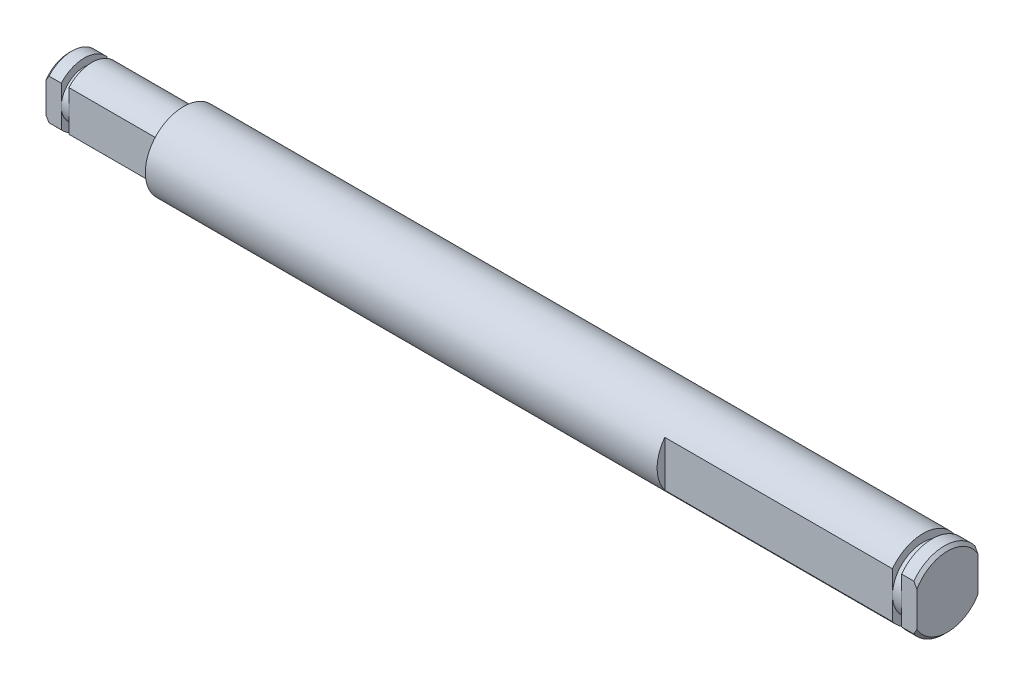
ISO-10303-21;
HEADER;
FILE_DESCRIPTION(('STEP AP214'),'2;1');
FILE_NAME('part.step','',(''),(''),'','','');
FILE_SCHEMA(('AUTOMOTIVE_DESIGN { 1 0 10303 214 1 1 1 1 }'));
ENDSEC;
DATA;
#1=APPLICATION_CONTEXT('core data for automotive mechanical design processes');
#2=APPLICATION_PROTOCOL_DEFINITION('international standard','automotive_design',2000,#1);
#3=PRODUCT_CONTEXT('',#1,'mechanical');
#4=PRODUCT('Part','Part','',(#3));
#5=PRODUCT_RELATED_PRODUCT_CATEGORY('part','',(#4));
#6=PRODUCT_DEFINITION_FORMATION('','',#4);
#7=PRODUCT_DEFINITION_CONTEXT('part definition',#1,'design');
#8=PRODUCT_DEFINITION('design','',#6,#7);
#9=PRODUCT_DEFINITION_SHAPE('','',#8);
#10=(LENGTH_UNIT() NAMED_UNIT(*) SI_UNIT(.MILLI.,.METRE.));
#11=(NAMED_UNIT(*) PLANE_ANGLE_UNIT() SI_UNIT($,.RADIAN.));
#12=(NAMED_UNIT(*) SI_UNIT($,.STERADIAN.) SOLID_ANGLE_UNIT());
#13=UNCERTAINTY_MEASURE_WITH_UNIT(LENGTH_MEASURE(1.E-05),#10,'distance_accuracy_value','');
#14=(GEOMETRIC_REPRESENTATION_CONTEXT(3) GLOBAL_UNCERTAINTY_ASSIGNED_CONTEXT((#13)) GLOBAL_UNIT_ASSIGNED_CONTEXT((#10,
#11,#12)) REPRESENTATION_CONTEXT('',''));
#15=CARTESIAN_POINT('',(0.,0.,0.));
#16=DIRECTION('',(0.,0.,1.));
#17=DIRECTION('',(1.,0.,0.));
#18=AXIS2_PLACEMENT_3D('',#15,#16,#17);
#19=CARTESIAN_POINT('',(-14.5998699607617,0.,0.));
#20=DIRECTION('',(1.,0.,0.));
#21=DIRECTION('',(0.,0.,-1.));
#22=AXIS2_PLACEMENT_3D('',#19,#20,#21);
#23=CONICAL_SURFACE('',#22,3.99999999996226,0.78538190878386);
#24=CARTESIAN_POINT('',(-14.5998699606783,2.64575131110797,-2.99999999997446));
#25=CARTESIAN_POINT('',(-14.6352080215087,2.592322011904,-2.99999999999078));
#26=CARTESIAN_POINT('',(-14.6701329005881,2.53861676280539,-2.99999999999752));
#27=CARTESIAN_POINT('',(-14.7390206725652,2.43062279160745,-3.00000000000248));
#28=CARTESIAN_POINT('',(-14.7729839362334,2.37633430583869,-3.00000000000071));
#29=CARTESIAN_POINT('',(-14.8398428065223,2.26709711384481,-2.99999999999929));
#30=CARTESIAN_POINT('',(-14.8727383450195,2.21214836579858,-2.99999999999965));
#31=CARTESIAN_POINT('',(-14.9373190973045,2.10151601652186,-3.00000000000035));
#32=CARTESIAN_POINT('',(-14.9690038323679,2.04583213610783,-3.00000000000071));
#33=CARTESIAN_POINT('',(-15.0000000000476,1.98976314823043,-3.));
#34=B_SPLINE_CURVE_WITH_KNOTS('',3,(#24,#25,#26,#27,#28,#29,#30,#31,#32,#33),.UNSPECIFIED.,.F.,
.F.,(4,2,2,2,4),(0.,0.192176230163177,0.38427732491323,0.576390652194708,0.768579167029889),.UNSPECIFIED.);
#35=CARTESIAN_POINT('',(-14.59986996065,2.64575131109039,-3.));
#36=VERTEX_POINT('',#35);
#37=CARTESIAN_POINT('',(-15.000000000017,1.9897631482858,-3.));
#38=VERTEX_POINT('',#37);
#39=EDGE_CURVE('E191',#36,#38,#34,.T.);
#40=ORIENTED_EDGE('',*,*,#39,.T.);
#41=CARTESIAN_POINT('',(-14.9999999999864,0.,0.));
#42=DIRECTION('',(1.,0.,0.));
#43=DIRECTION('',(0.,0.,-1.));
#44=AXIS2_PLACEMENT_3D('',#41,#42,#43);
#45=CIRCLE('',#44,3.59988296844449);
#46=CARTESIAN_POINT('',(-15.0000000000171,1.98976314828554,3.));
#47=VERTEX_POINT('',#46);
#48=EDGE_CURVE('E189',#38,#47,#45,.T.);
#49=ORIENTED_EDGE('',*,*,#48,.T.);
#50=CARTESIAN_POINT('',(-15.0000000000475,1.98976314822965,2.99999999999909));
#51=CARTESIAN_POINT('',(-14.9690038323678,2.04583213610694,2.99999999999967));
#52=CARTESIAN_POINT('',(-14.9373190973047,2.10151601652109,2.99999999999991));
#53=CARTESIAN_POINT('',(-14.8727383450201,2.21214836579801,3.00000000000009));
#54=CARTESIAN_POINT('',(-14.839842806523,2.26709711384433,3.00000000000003));
#55=CARTESIAN_POINT('',(-14.7729839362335,2.3763343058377,2.99999999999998));
#56=CARTESIAN_POINT('',(-14.7390206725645,2.43062279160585,2.99999999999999));
#57=CARTESIAN_POINT('',(-14.6701329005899,2.53861676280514,3.00000000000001));
#58=CARTESIAN_POINT('',(-14.6352080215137,2.59232201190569,3.00000000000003));
#59=CARTESIAN_POINT('',(-14.5998699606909,2.64575131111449,3.));
#60=B_SPLINE_CURVE_WITH_KNOTS('',3,(#50,#51,#52,#53,#54,#55,#56,#57,#58,#59),.UNSPECIFIED.,.F.,
.F.,(4,2,2,2,4),(0.,0.19218851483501,0.384301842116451,0.576402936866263,0.768579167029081),.UNSPECIFIED.);
#61=CARTESIAN_POINT('',(-14.5998699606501,2.64575131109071,3.));
#62=VERTEX_POINT('',#61);
#63=EDGE_CURVE('E21',#47,#62,#60,.T.);
#64=ORIENTED_EDGE('',*,*,#63,.T.);
#65=CARTESIAN_POINT('',(-14.59986996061,0.,0.));
#66=DIRECTION('',(1.,0.,0.));
#67=DIRECTION('',(0.,0.,-1.));
#68=AXIS2_PLACEMENT_3D('',#65,#66,#67);
#69=CIRCLE('',#68,4.);
#70=EDGE_CURVE('E186',#36,#62,#69,.T.);
#71=ORIENTED_EDGE('',*,*,#70,.F.);
#72=EDGE_LOOP('',(#40,#49,#64,#71));
#73=FACE_BOUND('',#72,.T.);
#74=ADVANCED_FACE('F17',(#73),#23,.T.);
#75=CARTESIAN_POINT('',(-14.5998699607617,0.,0.));
#76=DIRECTION('',(1.,0.,0.));
#77=DIRECTION('',(0.,0.,-1.));
#78=AXIS2_PLACEMENT_3D('',#75,#76,#77);
#79=CONICAL_SURFACE('',#78,3.99999999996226,0.78538190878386);
#80=CARTESIAN_POINT('',(-14.59986996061,0.,0.));
#81=DIRECTION('',(1.,0.,0.));
#82=DIRECTION('',(0.,0.,-1.));
#83=AXIS2_PLACEMENT_3D('',#80,#81,#82);
#84=CIRCLE('',#83,4.);
#85=CARTESIAN_POINT('',(-14.59986996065,-2.64575131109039,3.));
#86=VERTEX_POINT('',#85);
#87=CARTESIAN_POINT('',(-14.5998699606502,-2.64575131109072,-3.));
#88=VERTEX_POINT('',#87);
#89=EDGE_CURVE('E200',#86,#88,#84,.T.);
#90=ORIENTED_EDGE('',*,*,#89,.F.);
#91=CARTESIAN_POINT('',(-14.5998699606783,-2.64575131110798,2.99999999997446));
#92=CARTESIAN_POINT('',(-14.6352080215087,-2.59232201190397,2.99999999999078));
#93=CARTESIAN_POINT('',(-14.6701329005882,-2.53861676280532,2.99999999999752));
#94=CARTESIAN_POINT('',(-14.7390206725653,-2.43062279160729,3.00000000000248));
#95=CARTESIAN_POINT('',(-14.7729839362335,-2.37633430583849,3.00000000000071));
#96=CARTESIAN_POINT('',(-14.8398428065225,-2.26709711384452,2.99999999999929));
#97=CARTESIAN_POINT('',(-14.8727383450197,-2.21214836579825,2.99999999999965));
#98=CARTESIAN_POINT('',(-14.9373190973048,-2.10151601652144,3.00000000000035));
#99=CARTESIAN_POINT('',(-14.9690038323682,-2.04583213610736,3.00000000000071));
#100=CARTESIAN_POINT('',(-15.0000000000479,-1.98976314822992,3.));
#101=B_SPLINE_CURVE_WITH_KNOTS('',3,(#91,#92,#93,#94,#95,#96,#97,#98,#99,#100),.UNSPECIFIED.,
.F.,.F.,(4,2,2,2,4),(0.,0.192176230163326,0.384277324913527,0.576390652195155,
0.768579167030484),.UNSPECIFIED.);
#102=CARTESIAN_POINT('',(-15.0000000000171,-1.98976314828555,3.));
#103=VERTEX_POINT('',#102);
#104=EDGE_CURVE('E690',#86,#103,#101,.T.);
#105=ORIENTED_EDGE('',*,*,#104,.T.);
#106=CARTESIAN_POINT('',(-14.9999999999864,0.,0.));
#107=DIRECTION('',(1.,0.,0.));
#108=DIRECTION('',(0.,0.,-1.));
#109=AXIS2_PLACEMENT_3D('',#106,#107,#108);
#110=CIRCLE('',#109,3.59988296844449);
#111=CARTESIAN_POINT('',(-15.0000000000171,-1.98976314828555,-3.));
#112=VERTEX_POINT('',#111);
#113=EDGE_CURVE('E701',#103,#112,#110,.T.);
#114=ORIENTED_EDGE('',*,*,#113,.T.);
#115=CARTESIAN_POINT('',(-15.0000000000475,-1.98976314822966,-2.99999999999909));
#116=CARTESIAN_POINT('',(-14.9690038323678,-2.04583213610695,-2.99999999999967));
#117=CARTESIAN_POINT('',(-14.9373190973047,-2.1015160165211,-2.99999999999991));
#118=CARTESIAN_POINT('',(-14.8727383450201,-2.21214836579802,-3.00000000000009));
#119=CARTESIAN_POINT('',(-14.839842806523,-2.26709711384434,-3.00000000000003));
#120=CARTESIAN_POINT('',(-14.7729839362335,-2.37633430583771,-2.99999999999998));
#121=CARTESIAN_POINT('',(-14.7390206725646,-2.43062279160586,-2.99999999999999));
#122=CARTESIAN_POINT('',(-14.6701329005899,-2.53861676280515,-3.00000000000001));
#123=CARTESIAN_POINT('',(-14.6352080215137,-2.5923220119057,-3.00000000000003));
#124=CARTESIAN_POINT('',(-14.5998699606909,-2.6457513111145,-3.));
#125=B_SPLINE_CURVE_WITH_KNOTS('',3,(#115,#116,#117,#118,#119,#120,#121,#122,#123,#124),
.UNSPECIFIED.,.F.,.F.,(4,2,2,2,4),(0.,0.192188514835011,0.384301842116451,0.576402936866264,
0.768579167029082),.UNSPECIFIED.);
#126=EDGE_CURVE('E695',#112,#88,#125,.T.);
#127=ORIENTED_EDGE('',*,*,#126,.T.);
#128=EDGE_LOOP('',(#90,#105,#114,#127));
#129=FACE_BOUND('',#128,.T.);
#130=ADVANCED_FACE('F668',(#129),#79,.T.);
#131=CARTESIAN_POINT('',(-15.,0.,0.));
#132=DIRECTION('',(1.,0.,0.));
#133=DIRECTION('',(0.,0.,-1.));
#134=AXIS2_PLACEMENT_3D('',#131,#132,#133);
#135=PLANE('',#134);
#136=DIRECTION('',(0.,1.,0.));
#137=VECTOR('',#136,1.);
#138=CARTESIAN_POINT('',(-15.,4.,-3.));
#139=LINE('',#138,#137);
#140=EDGE_CURVE('E208',#38,#112,#139,.F.);
#141=ORIENTED_EDGE('',*,*,#140,.T.);
#142=ORIENTED_EDGE('',*,*,#113,.F.);
#143=DIRECTION('',(0.,1.,0.));
#144=VECTOR('',#143,1.);
#145=CARTESIAN_POINT('',(-15.,-4.,3.));
#146=LINE('',#145,#144);
#147=EDGE_CURVE('E206',#103,#47,#146,.T.);
#148=ORIENTED_EDGE('',*,*,#147,.T.);
#149=ORIENTED_EDGE('',*,*,#48,.F.);
#150=EDGE_LOOP('',(#141,#142,#148,#149));
#151=FACE_BOUND('',#150,.T.);
#152=ADVANCED_FACE('F661',(#151),#135,.F.);
#153=CARTESIAN_POINT('',(0.,0.,0.));
#154=DIRECTION('',(1.,0.,0.));
#155=DIRECTION('',(0.,0.,-1.));
#156=AXIS2_PLACEMENT_3D('',#153,#154,#155);
#157=CYLINDRICAL_SURFACE('',#156,4.);
#158=DIRECTION('',(-1.,0.,0.));
#159=VECTOR('',#158,1.);
#160=CARTESIAN_POINT('',(0.,2.645751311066,3.));
#161=LINE('',#160,#159);
#162=CARTESIAN_POINT('',(-13.,2.6457513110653,3.));
#163=VERTEX_POINT('',#162);
#164=EDGE_CURVE('E196',#62,#163,#161,.F.);
#165=ORIENTED_EDGE('',*,*,#164,.T.);
#166=CARTESIAN_POINT('',(-13.,0.,0.));
#167=DIRECTION('',(1.,0.,0.));
#168=DIRECTION('',(0.,0.,-1.));
#169=AXIS2_PLACEMENT_3D('',#166,#167,#168);
#170=CIRCLE('',#169,4.);
#171=CARTESIAN_POINT('',(-13.,2.6457513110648,-3.));
#172=VERTEX_POINT('',#171);
#173=EDGE_CURVE('E225',#163,#172,#170,.F.);
#174=ORIENTED_EDGE('',*,*,#173,.T.);
#175=DIRECTION('',(1.,0.,0.));
#176=VECTOR('',#175,1.);
#177=CARTESIAN_POINT('',(0.,2.645751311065,-3.));
#178=LINE('',#177,#176);
#179=EDGE_CURVE('E199',#172,#36,#178,.F.);
#180=ORIENTED_EDGE('',*,*,#179,.T.);
#181=ORIENTED_EDGE('',*,*,#70,.T.);
#182=EDGE_LOOP('',(#165,#174,#180,#181));
#183=FACE_BOUND('',#182,.T.);
#184=ADVANCED_FACE('F195',(#183),#157,.T.);
#185=CARTESIAN_POINT('',(0.,0.,0.));
#186=DIRECTION('',(1.,0.,0.));
#187=DIRECTION('',(0.,0.,-1.));
#188=AXIS2_PLACEMENT_3D('',#185,#186,#187);
#189=CYLINDRICAL_SURFACE('',#188,4.);
#190=DIRECTION('',(1.,0.,0.));
#191=VECTOR('',#190,1.);
#192=CARTESIAN_POINT('',(0.,-2.645751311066,-3.));
#193=LINE('',#192,#191);
#194=CARTESIAN_POINT('',(-13.,-2.6457513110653,-3.));
#195=VERTEX_POINT('',#194);
#196=EDGE_CURVE('E215',#88,#195,#193,.T.);
#197=ORIENTED_EDGE('',*,*,#196,.T.);
#198=CARTESIAN_POINT('',(-13.,0.,0.));
#199=DIRECTION('',(1.,0.,0.));
#200=DIRECTION('',(0.,0.,-1.));
#201=AXIS2_PLACEMENT_3D('',#198,#199,#200);
#202=CIRCLE('',#201,4.);
#203=CARTESIAN_POINT('',(-13.,-2.6457513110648,3.));
#204=VERTEX_POINT('',#203);
#205=EDGE_CURVE('E222',#195,#204,#202,.F.);
#206=ORIENTED_EDGE('',*,*,#205,.T.);
#207=DIRECTION('',(-1.,0.,0.));
#208=VECTOR('',#207,1.);
#209=CARTESIAN_POINT('',(0.,-2.645751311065,3.));
#210=LINE('',#209,#208);
#211=EDGE_CURVE('E210',#204,#86,#210,.T.);
#212=ORIENTED_EDGE('',*,*,#211,.T.);
#213=ORIENTED_EDGE('',*,*,#89,.T.);
#214=EDGE_LOOP('',(#197,#206,#212,#213));
#215=FACE_BOUND('',#214,.T.);
#216=ADVANCED_FACE('F648',(#215),#189,.T.);
#217=CARTESIAN_POINT('',(0.,-4.,3.));
#218=DIRECTION('',(0.,0.,-1.));
#219=DIRECTION('',(-1.,0.,0.));
#220=AXIS2_PLACEMENT_3D('',#217,#218,#219);
#221=PLANE('',#220);
#222=ORIENTED_EDGE('',*,*,#164,.F.);
#223=ORIENTED_EDGE('',*,*,#63,.F.);
#224=ORIENTED_EDGE('',*,*,#147,.F.);
#225=ORIENTED_EDGE('',*,*,#104,.F.);
#226=ORIENTED_EDGE('',*,*,#211,.F.);
#227=DIRECTION('',(0.,1.,0.));
#228=VECTOR('',#227,1.);
#229=CARTESIAN_POINT('',(-13.,0.,3.));
#230=LINE('',#229,#228);
#231=CARTESIAN_POINT('',(-13.,0.,3.));
#232=VERTEX_POINT('',#231);
#233=EDGE_CURVE('E230',#204,#232,#230,.T.);
#234=ORIENTED_EDGE('',*,*,#233,.T.);
#235=DIRECTION('',(0.,1.,0.));
#236=VECTOR('',#235,1.);
#237=CARTESIAN_POINT('',(-13.,0.,3.));
#238=LINE('',#237,#236);
#239=EDGE_CURVE('E205',#232,#163,#238,.T.);
#240=ORIENTED_EDGE('',*,*,#239,.T.);
#241=EDGE_LOOP('',(#222,#223,#224,#225,#226,#234,#240));
#242=FACE_BOUND('',#241,.T.);
#243=ADVANCED_FACE('F202',(#242),#221,.F.);
#244=CARTESIAN_POINT('',(0.,4.,-3.));
#245=DIRECTION('',(0.,0.,1.));
#246=DIRECTION('',(1.,0.,0.));
#247=AXIS2_PLACEMENT_3D('',#244,#245,#246);
#248=PLANE('',#247);
#249=ORIENTED_EDGE('',*,*,#196,.F.);
#250=ORIENTED_EDGE('',*,*,#126,.F.);
#251=ORIENTED_EDGE('',*,*,#140,.F.);
#252=ORIENTED_EDGE('',*,*,#39,.F.);
#253=ORIENTED_EDGE('',*,*,#179,.F.);
#254=DIRECTION('',(0.,1.,0.));
#255=VECTOR('',#254,1.);
#256=CARTESIAN_POINT('',(-13.,0.,-3.));
#257=LINE('',#256,#255);
#258=CARTESIAN_POINT('',(-13.,0.,-3.));
#259=VERTEX_POINT('',#258);
#260=EDGE_CURVE('E223',#172,#259,#257,.F.);
#261=ORIENTED_EDGE('',*,*,#260,.T.);
#262=DIRECTION('',(0.,1.,0.));
#263=VECTOR('',#262,1.);
#264=CARTESIAN_POINT('',(-13.,0.,-3.));
#265=LINE('',#264,#263);
#266=EDGE_CURVE('E226',#259,#195,#265,.F.);
#267=ORIENTED_EDGE('',*,*,#266,.T.);
#268=EDGE_LOOP('',(#249,#250,#251,#252,#253,#261,#267));
#269=FACE_BOUND('',#268,.T.);
#270=ADVANCED_FACE('F440',(#269),#248,.F.);
#271=CARTESIAN_POINT('',(99.599822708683,0.,0.));
#272=DIRECTION('',(-1.,0.,0.));
#273=DIRECTION('',(0.,-1.,0.));
#274=AXIS2_PLACEMENT_3D('',#271,#272,#273);
#275=CONICAL_SURFACE('',#274,4.99999999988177,0.785380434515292);
#276=CARTESIAN_POINT('',(99.59982270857,0.,0.));
#277=DIRECTION('',(1.,0.,0.));
#278=DIRECTION('',(0.,0.,-1.));
#279=AXIS2_PLACEMENT_3D('',#276,#277,#278);
#280=CIRCLE('',#279,5.);
#281=CARTESIAN_POINT('',(99.599822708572,-2.99999999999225,-4.));
#282=VERTEX_POINT('',#281);
#283=CARTESIAN_POINT('',(99.599822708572,-2.99999999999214,4.00000000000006));
#284=VERTEX_POINT('',#283);
#285=EDGE_CURVE('E326',#282,#284,#280,.F.);
#286=ORIENTED_EDGE('',*,*,#285,.F.);
#287=CARTESIAN_POINT('',(99.5998227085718,-2.9999999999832,-3.99999999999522));
#288=CARTESIAN_POINT('',(99.6354838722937,-2.94056285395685,-3.99999999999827));
#289=CARTESIAN_POINT('',(99.6706509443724,-2.8808266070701,-3.99999999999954));
#290=CARTESIAN_POINT('',(99.7398612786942,-2.76074011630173,-4.00000000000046));
#291=CARTESIAN_POINT('',(99.7739050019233,-2.70039013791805,-4.00000000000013));
#292=CARTESIAN_POINT('',(99.8407646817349,-2.57900773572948,-3.99999999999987));
#293=CARTESIAN_POINT('',(99.8735805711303,-2.51797527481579,-3.99999999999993));
#294=CARTESIAN_POINT('',(99.9378513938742,-2.39516619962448,-4.00000000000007));
#295=CARTESIAN_POINT('',(99.9693057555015,-2.33338928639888,-4.00000000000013));
#296=CARTESIAN_POINT('',(100.000000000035,-2.27123303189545,-4.));
#297=B_SPLINE_CURVE_WITH_KNOTS('',3,(#287,#288,#289,#290,#291,#292,#293,#294,#295,#296),
.UNSPECIFIED.,.F.,.F.,(4,2,2,2,4),(0.,0.207944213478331,0.415802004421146,0.623671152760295,
0.83162675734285),.UNSPECIFIED.);
#298=CARTESIAN_POINT('',(100.000000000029,-2.27123303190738,-4.));
#299=VERTEX_POINT('',#298);
#300=EDGE_CURVE('E428',#282,#299,#297,.T.);
#301=ORIENTED_EDGE('',*,*,#300,.T.);
#302=CARTESIAN_POINT('',(100.000000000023,0.,0.));
#303=DIRECTION('',(-1.,0.,0.));
#304=DIRECTION('',(0.,-1.,0.));
#305=AXIS2_PLACEMENT_3D('',#302,#303,#304);
#306=CIRCLE('',#305,4.5998368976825);
#307=CARTESIAN_POINT('',(100.000000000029,-2.27123303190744,4.));
#308=VERTEX_POINT('',#307);
#309=EDGE_CURVE('E371',#308,#299,#306,.F.);
#310=ORIENTED_EDGE('',*,*,#309,.F.);
#311=CARTESIAN_POINT('',(100.000000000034,-2.27123303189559,4.));
#312=CARTESIAN_POINT('',(99.9693057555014,-2.33338928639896,4.));
#313=CARTESIAN_POINT('',(99.9378513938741,-2.39516619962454,4.));
#314=CARTESIAN_POINT('',(99.8735805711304,-2.51797527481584,4.));
#315=CARTESIAN_POINT('',(99.840764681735,-2.57900773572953,4.));
#316=CARTESIAN_POINT('',(99.7739050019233,-2.70039013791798,4.));
#317=CARTESIAN_POINT('',(99.739861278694,-2.76074011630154,4.));
#318=CARTESIAN_POINT('',(99.6706509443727,-2.88082660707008,4.));
#319=CARTESIAN_POINT('',(99.6354838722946,-2.94056285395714,4.));
#320=CARTESIAN_POINT('',(99.5998227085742,-2.99999999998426,4.));
#321=B_SPLINE_CURVE_WITH_KNOTS('',3,(#311,#312,#313,#314,#315,#316,#317,#318,#319,#320),
.UNSPECIFIED.,.F.,.F.,(4,2,2,2,4),(0.,0.207955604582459,0.415824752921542,0.623682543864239,
0.831626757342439),.UNSPECIFIED.);
#322=EDGE_CURVE('E218',#308,#284,#321,.T.);
#323=ORIENTED_EDGE('',*,*,#322,.T.);
#324=EDGE_LOOP('',(#286,#301,#310,#323));
#325=FACE_BOUND('',#324,.T.);
#326=ADVANCED_FACE('F434',(#325),#275,.T.);
#327=CARTESIAN_POINT('',(-13.,0.,0.));
#328=DIRECTION('',(-1.,0.,0.));
#329=DIRECTION('',(0.,0.,1.));
#330=AXIS2_PLACEMENT_3D('',#327,#328,#329);
#331=PLANE('',#330);
#332=ORIENTED_EDGE('',*,*,#239,.F.);
#333=CARTESIAN_POINT('',(-13.,0.,0.));
#334=DIRECTION('',(-1.,0.,0.));
#335=DIRECTION('',(0.,0.,1.));
#336=AXIS2_PLACEMENT_3D('',#333,#334,#335);
#337=CIRCLE('',#336,3.);
#338=EDGE_CURVE('E369',#259,#232,#337,.F.);
#339=ORIENTED_EDGE('',*,*,#338,.F.);
#340=ORIENTED_EDGE('',*,*,#260,.F.);
#341=ORIENTED_EDGE('',*,*,#173,.F.);
#342=EDGE_LOOP('',(#332,#339,#340,#341));
#343=FACE_BOUND('',#342,.T.);
#344=ADVANCED_FACE('F439',(#343),#331,.F.);
#345=CARTESIAN_POINT('',(-13.,0.,0.));
#346=DIRECTION('',(-1.,0.,0.));
#347=DIRECTION('',(0.,0.,1.));
#348=AXIS2_PLACEMENT_3D('',#345,#346,#347);
#349=PLANE('',#348);
#350=CARTESIAN_POINT('',(-13.,0.,0.));
#351=DIRECTION('',(-1.,0.,0.));
#352=DIRECTION('',(0.,0.,1.));
#353=AXIS2_PLACEMENT_3D('',#350,#351,#352);
#354=CIRCLE('',#353,3.);
#355=EDGE_CURVE('E366',#232,#259,#354,.F.);
#356=ORIENTED_EDGE('',*,*,#355,.F.);
#357=ORIENTED_EDGE('',*,*,#233,.F.);
#358=ORIENTED_EDGE('',*,*,#205,.F.);
#359=ORIENTED_EDGE('',*,*,#266,.F.);
#360=EDGE_LOOP('',(#356,#357,#358,#359));
#361=FACE_BOUND('',#360,.T.);
#362=ADVANCED_FACE('F445',(#361),#349,.F.);
#363=CARTESIAN_POINT('',(0.,0.,0.));
#364=DIRECTION('',(1.,0.,0.));
#365=DIRECTION('',(0.,0.,-1.));
#366=AXIS2_PLACEMENT_3D('',#363,#364,#365);
#367=CYLINDRICAL_SURFACE('',#366,5.);
#368=DIRECTION('',(1.,0.,0.));
#369=VECTOR('',#368,1.);
#370=CARTESIAN_POINT('',(0.,-2.99999999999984,4.00000000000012));
#371=LINE('',#370,#369);
#372=CARTESIAN_POINT('',(98.,-2.99999999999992,4.00000000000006));
#373=VERTEX_POINT('',#372);
#374=EDGE_CURVE('E323',#284,#373,#371,.F.);
#375=ORIENTED_EDGE('',*,*,#374,.T.);
#376=CARTESIAN_POINT('',(98.,0.,0.));
#377=DIRECTION('',(1.,0.,0.));
#378=DIRECTION('',(0.,0.,-1.));
#379=AXIS2_PLACEMENT_3D('',#376,#377,#378);
#380=CIRCLE('',#379,5.);
#381=CARTESIAN_POINT('',(98.,-3.,-4.));
#382=VERTEX_POINT('',#381);
#383=EDGE_CURVE('E322',#373,#382,#380,.T.);
#384=ORIENTED_EDGE('',*,*,#383,.T.);
#385=DIRECTION('',(1.,0.,0.));
#386=VECTOR('',#385,1.);
#387=CARTESIAN_POINT('',(0.,-3.,-4.));
#388=LINE('',#387,#386);
#389=EDGE_CURVE('E229',#382,#282,#388,.T.);
#390=ORIENTED_EDGE('',*,*,#389,.T.);
#391=ORIENTED_EDGE('',*,*,#285,.T.);
#392=EDGE_LOOP('',(#375,#384,#390,#391));
#393=FACE_BOUND('',#392,.T.);
#394=ADVANCED_FACE('F398',(#393),#367,.T.);
#395=CARTESIAN_POINT('',(99.599822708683,0.,0.));
#396=DIRECTION('',(-1.,0.,0.));
#397=DIRECTION('',(0.,-1.,0.));
#398=AXIS2_PLACEMENT_3D('',#395,#396,#397);
#399=CONICAL_SURFACE('',#398,4.99999999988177,0.785380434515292);
#400=CARTESIAN_POINT('',(100.000000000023,0.,0.));
#401=DIRECTION('',(-1.,0.,0.));
#402=DIRECTION('',(0.,-1.,0.));
#403=AXIS2_PLACEMENT_3D('',#400,#401,#402);
#404=CIRCLE('',#403,4.59983689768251);
#405=CARTESIAN_POINT('',(100.000000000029,2.27123303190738,-4.));
#406=VERTEX_POINT('',#405);
#407=CARTESIAN_POINT('',(100.000000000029,2.27123303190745,4.));
#408=VERTEX_POINT('',#407);
#409=EDGE_CURVE('E374',#406,#408,#404,.F.);
#410=ORIENTED_EDGE('',*,*,#409,.F.);
#411=CARTESIAN_POINT('',(100.000000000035,2.27123303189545,-4.));
#412=CARTESIAN_POINT('',(99.9693057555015,2.33338928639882,-4.));
#413=CARTESIAN_POINT('',(99.9378513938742,2.39516619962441,-4.));
#414=CARTESIAN_POINT('',(99.8735805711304,2.5179752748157,-4.));
#415=CARTESIAN_POINT('',(99.8407646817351,2.57900773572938,-4.));
#416=CARTESIAN_POINT('',(99.7739050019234,2.70039013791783,-4.));
#417=CARTESIAN_POINT('',(99.7398612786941,2.76074011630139,-4.));
#418=CARTESIAN_POINT('',(99.6706509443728,2.88082660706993,-4.));
#419=CARTESIAN_POINT('',(99.6354838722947,2.94056285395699,-4.));
#420=CARTESIAN_POINT('',(99.5998227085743,2.99999999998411,-4.));
#421=B_SPLINE_CURVE_WITH_KNOTS('',3,(#411,#412,#413,#414,#415,#416,#417,#418,#419,#420),
.UNSPECIFIED.,.F.,.F.,(4,2,2,2,4),(0.,0.207955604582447,0.415824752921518,0.623682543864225,
0.83162675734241),.UNSPECIFIED.);
#422=CARTESIAN_POINT('',(99.5998227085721,2.99999999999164,-4.));
#423=VERTEX_POINT('',#422);
#424=EDGE_CURVE('E377',#406,#423,#421,.T.);
#425=ORIENTED_EDGE('',*,*,#424,.T.);
#426=CARTESIAN_POINT('',(99.59982270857,0.,0.));
#427=DIRECTION('',(1.,0.,0.));
#428=DIRECTION('',(0.,0.,-1.));
#429=AXIS2_PLACEMENT_3D('',#426,#427,#428);
#430=CIRCLE('',#429,5.);
#431=CARTESIAN_POINT('',(99.5998227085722,2.99999999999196,4.));
#432=VERTEX_POINT('',#431);
#433=EDGE_CURVE('E319',#432,#423,#430,.F.);
#434=ORIENTED_EDGE('',*,*,#433,.F.);
#435=CARTESIAN_POINT('',(99.5998227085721,2.99999999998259,3.99999999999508));
#436=CARTESIAN_POINT('',(99.635483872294,2.94056285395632,3.99999999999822));
#437=CARTESIAN_POINT('',(99.6706509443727,2.88082660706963,3.99999999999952));
#438=CARTESIAN_POINT('',(99.7398612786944,2.76074011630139,4.00000000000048));
#439=CARTESIAN_POINT('',(99.7739050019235,2.70039013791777,4.00000000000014));
#440=CARTESIAN_POINT('',(99.840764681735,2.57900773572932,3.99999999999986));
#441=CARTESIAN_POINT('',(99.8735805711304,2.51797527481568,3.99999999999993));
#442=CARTESIAN_POINT('',(99.9378513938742,2.3951661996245,4.00000000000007));
#443=CARTESIAN_POINT('',(99.9693057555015,2.33338928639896,4.00000000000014));
#444=CARTESIAN_POINT('',(100.000000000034,2.27123303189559,4.));
#445=B_SPLINE_CURVE_WITH_KNOTS('',3,(#435,#436,#437,#438,#439,#440,#441,#442,#443,#444),
.UNSPECIFIED.,.F.,.F.,(4,2,2,2,4),(0.,0.207944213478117,0.415802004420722,0.623671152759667,
0.83162675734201),.UNSPECIFIED.);
#446=EDGE_CURVE('E325',#432,#408,#445,.T.);
#447=ORIENTED_EDGE('',*,*,#446,.T.);
#448=EDGE_LOOP('',(#410,#425,#434,#447));
#449=FACE_BOUND('',#448,.T.);
#450=ADVANCED_FACE('F392',(#449),#399,.T.);
#451=CARTESIAN_POINT('',(100.,0.,0.));
#452=DIRECTION('',(1.,0.,0.));
#453=DIRECTION('',(0.,0.,-1.));
#454=AXIS2_PLACEMENT_3D('',#451,#452,#453);
#455=PLANE('',#454);
#456=ORIENTED_EDGE('',*,*,#309,.T.);
#457=DIRECTION('',(0.,1.,0.));
#458=VECTOR('',#457,1.);
#459=CARTESIAN_POINT('',(100.,5.,-4.));
#460=LINE('',#459,#458);
#461=EDGE_CURVE('E243',#299,#406,#460,.T.);
#462=ORIENTED_EDGE('',*,*,#461,.T.);
#463=ORIENTED_EDGE('',*,*,#409,.T.);
#464=DIRECTION('',(0.,1.,0.));
#465=VECTOR('',#464,1.);
#466=CARTESIAN_POINT('',(100.,-5.,4.));
#467=LINE('',#466,#465);
#468=EDGE_CURVE('E232',#408,#308,#467,.F.);
#469=ORIENTED_EDGE('',*,*,#468,.T.);
#470=EDGE_LOOP('',(#456,#462,#463,#469));
#471=FACE_BOUND('',#470,.T.);
#472=ADVANCED_FACE('F397',(#471),#455,.T.);
#473=CARTESIAN_POINT('',(-13.,0.,0.));
#474=DIRECTION('',(-1.,0.,0.));
#475=DIRECTION('',(0.,0.,1.));
#476=AXIS2_PLACEMENT_3D('',#473,#474,#475);
#477=CYLINDRICAL_SURFACE('',#476,3.);
#478=CARTESIAN_POINT('',(-12.,0.,0.));
#479=DIRECTION('',(-1.,0.,0.));
#480=DIRECTION('',(0.,0.,1.));
#481=AXIS2_PLACEMENT_3D('',#478,#479,#480);
#482=CIRCLE('',#481,3.);
#483=CARTESIAN_POINT('',(-12.,0.,-3.));
#484=VERTEX_POINT('',#483);
#485=CARTESIAN_POINT('',(-12.,0.,3.));
#486=VERTEX_POINT('',#485);
#487=EDGE_CURVE('E242',#484,#486,#482,.F.);
#488=ORIENTED_EDGE('',*,*,#487,.F.);
#489=CARTESIAN_POINT('',(-12.,0.,0.));
#490=DIRECTION('',(-1.,0.,0.));
#491=DIRECTION('',(0.,0.,1.));
#492=AXIS2_PLACEMENT_3D('',#489,#490,#491);
#493=CIRCLE('',#492,3.);
#494=EDGE_CURVE('E359',#486,#484,#493,.F.);
#495=ORIENTED_EDGE('',*,*,#494,.F.);
#496=EDGE_LOOP('',(#488,#495));
#497=FACE_BOUND('',#496,.T.);
#498=ORIENTED_EDGE('',*,*,#338,.T.);
#499=ORIENTED_EDGE('',*,*,#355,.T.);
#500=EDGE_LOOP('',(#498,#499));
#501=FACE_BOUND('',#500,.T.);
#502=ADVANCED_FACE('F404',(#497,#501),#477,.T.);
#503=CARTESIAN_POINT('',(98.,0.,0.));
#504=DIRECTION('',(1.,0.,0.));
#505=DIRECTION('',(0.,0.,-1.));
#506=AXIS2_PLACEMENT_3D('',#503,#504,#505);
#507=PLANE('',#506);
#508=CARTESIAN_POINT('',(98.,0.,0.));
#509=DIRECTION('',(1.,0.,0.));
#510=DIRECTION('',(0.,0.,-1.));
#511=AXIS2_PLACEMENT_3D('',#508,#509,#510);
#512=CIRCLE('',#511,4.);
#513=CARTESIAN_POINT('',(98.,0.,-4.));
#514=VERTEX_POINT('',#513);
#515=CARTESIAN_POINT('',(98.,0.,4.));
#516=VERTEX_POINT('',#515);
#517=EDGE_CURVE('E356',#514,#516,#512,.F.);
#518=ORIENTED_EDGE('',*,*,#517,.F.);
#519=DIRECTION('',(0.,1.,0.));
#520=VECTOR('',#519,1.);
#521=CARTESIAN_POINT('',(98.,5.,-4.));
#522=LINE('',#521,#520);
#523=EDGE_CURVE('E235',#514,#382,#522,.F.);
#524=ORIENTED_EDGE('',*,*,#523,.T.);
#525=ORIENTED_EDGE('',*,*,#383,.F.);
#526=DIRECTION('',(0.,1.,0.));
#527=VECTOR('',#526,1.);
#528=CARTESIAN_POINT('',(98.,-5.,4.));
#529=LINE('',#528,#527);
#530=EDGE_CURVE('E239',#373,#516,#529,.T.);
#531=ORIENTED_EDGE('',*,*,#530,.T.);
#532=EDGE_LOOP('',(#518,#524,#525,#531));
#533=FACE_BOUND('',#532,.T.);
#534=ADVANCED_FACE('F408',(#533),#507,.F.);
#535=CARTESIAN_POINT('',(0.,0.,0.));
#536=DIRECTION('',(1.,0.,0.));
#537=DIRECTION('',(0.,0.,-1.));
#538=AXIS2_PLACEMENT_3D('',#535,#536,#537);
#539=CYLINDRICAL_SURFACE('',#538,5.);
#540=DIRECTION('',(1.,0.,0.));
#541=VECTOR('',#540,1.);
#542=CARTESIAN_POINT('',(67.,2.999999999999,-4.));
#543=LINE('',#542,#541);
#544=CARTESIAN_POINT('',(98.,2.9999999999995,-4.));
#545=VERTEX_POINT('',#544);
#546=EDGE_CURVE('E240',#423,#545,#543,.F.);
#547=ORIENTED_EDGE('',*,*,#546,.T.);
#548=CARTESIAN_POINT('',(98.,0.,0.));
#549=DIRECTION('',(1.,0.,0.));
#550=DIRECTION('',(0.,0.,-1.));
#551=AXIS2_PLACEMENT_3D('',#548,#549,#550);
#552=CIRCLE('',#551,5.);
#553=CARTESIAN_POINT('',(98.,3.,4.));
#554=VERTEX_POINT('',#553);
#555=EDGE_CURVE('E253',#545,#554,#552,.T.);
#556=ORIENTED_EDGE('',*,*,#555,.T.);
#557=DIRECTION('',(-1.,0.,0.));
#558=VECTOR('',#557,1.);
#559=CARTESIAN_POINT('',(67.,3.,4.));
#560=LINE('',#559,#558);
#561=EDGE_CURVE('E236',#554,#432,#560,.F.);
#562=ORIENTED_EDGE('',*,*,#561,.T.);
#563=ORIENTED_EDGE('',*,*,#433,.T.);
#564=EDGE_LOOP('',(#547,#556,#562,#563));
#565=FACE_BOUND('',#564,.T.);
#566=ADVANCED_FACE('F412',(#565),#539,.T.);
#567=CARTESIAN_POINT('',(67.,-5.,4.));
#568=DIRECTION('',(0.,0.,-1.));
#569=DIRECTION('',(-1.,0.,0.));
#570=AXIS2_PLACEMENT_3D('',#567,#568,#569);
#571=PLANE('',#570);
#572=ORIENTED_EDGE('',*,*,#322,.F.);
#573=ORIENTED_EDGE('',*,*,#468,.F.);
#574=ORIENTED_EDGE('',*,*,#446,.F.);
#575=ORIENTED_EDGE('',*,*,#561,.F.);
#576=DIRECTION('',(0.,1.,0.));
#577=VECTOR('',#576,1.);
#578=CARTESIAN_POINT('',(98.,0.,4.));
#579=LINE('',#578,#577);
#580=EDGE_CURVE('E250',#554,#516,#579,.F.);
#581=ORIENTED_EDGE('',*,*,#580,.T.);
#582=ORIENTED_EDGE('',*,*,#530,.F.);
#583=ORIENTED_EDGE('',*,*,#374,.F.);
#584=EDGE_LOOP('',(#572,#573,#574,#575,#581,#582,#583));
#585=FACE_BOUND('',#584,.T.);
#586=ADVANCED_FACE('F415',(#585),#571,.F.);
#587=CARTESIAN_POINT('',(67.,5.,-4.));
#588=DIRECTION('',(0.,0.,1.));
#589=DIRECTION('',(1.,0.,0.));
#590=AXIS2_PLACEMENT_3D('',#587,#588,#589);
#591=PLANE('',#590);
#592=ORIENTED_EDGE('',*,*,#424,.F.);
#593=ORIENTED_EDGE('',*,*,#461,.F.);
#594=ORIENTED_EDGE('',*,*,#300,.F.);
#595=ORIENTED_EDGE('',*,*,#389,.F.);
#596=ORIENTED_EDGE('',*,*,#523,.F.);
#597=DIRECTION('',(0.,1.,0.));
#598=VECTOR('',#597,1.);
#599=CARTESIAN_POINT('',(98.,0.,-4.));
#600=LINE('',#599,#598);
#601=EDGE_CURVE('E246',#514,#545,#600,.T.);
#602=ORIENTED_EDGE('',*,*,#601,.T.);
#603=ORIENTED_EDGE('',*,*,#546,.F.);
#604=EDGE_LOOP('',(#592,#593,#594,#595,#596,#602,#603));
#605=FACE_BOUND('',#604,.T.);
#606=ADVANCED_FACE('F389',(#605),#591,.F.);
#607=CARTESIAN_POINT('',(-12.,0.,0.));
#608=DIRECTION('',(-1.,0.,0.));
#609=DIRECTION('',(0.,0.,1.));
#610=AXIS2_PLACEMENT_3D('',#607,#608,#609);
#611=PLANE('',#610);
#612=CARTESIAN_POINT('',(-12.,0.,0.));
#613=DIRECTION('',(1.,0.,0.));
#614=DIRECTION('',(0.,0.,-1.));
#615=AXIS2_PLACEMENT_3D('',#612,#613,#614);
#616=CIRCLE('',#615,4.);
#617=CARTESIAN_POINT('',(-12.,2.6457513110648,-3.));
#618=VERTEX_POINT('',#617);
#619=CARTESIAN_POINT('',(-12.,2.64575131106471,2.9999999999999));
#620=VERTEX_POINT('',#619);
#621=EDGE_CURVE('E303',#618,#620,#616,.T.);
#622=ORIENTED_EDGE('',*,*,#621,.F.);
#623=DIRECTION('',(0.,1.,0.));
#624=VECTOR('',#623,1.);
#625=CARTESIAN_POINT('',(-12.,4.,-3.));
#626=LINE('',#625,#624);
#627=EDGE_CURVE('E308',#618,#484,#626,.F.);
#628=ORIENTED_EDGE('',*,*,#627,.T.);
#629=ORIENTED_EDGE('',*,*,#487,.T.);
#630=DIRECTION('',(0.,1.,0.));
#631=VECTOR('',#630,1.);
#632=CARTESIAN_POINT('',(-12.,-4.,3.));
#633=LINE('',#632,#631);
#634=EDGE_CURVE('E307',#486,#620,#633,.T.);
#635=ORIENTED_EDGE('',*,*,#634,.T.);
#636=EDGE_LOOP('',(#622,#628,#629,#635));
#637=FACE_BOUND('',#636,.T.);
#638=ADVANCED_FACE('F584',(#637),#611,.T.);
#639=CARTESIAN_POINT('',(-12.,0.,0.));
#640=DIRECTION('',(-1.,0.,0.));
#641=DIRECTION('',(0.,0.,1.));
#642=AXIS2_PLACEMENT_3D('',#639,#640,#641);
#643=PLANE('',#642);
#644=CARTESIAN_POINT('',(-12.,0.,0.));
#645=DIRECTION('',(1.,0.,0.));
#646=DIRECTION('',(0.,0.,-1.));
#647=AXIS2_PLACEMENT_3D('',#644,#645,#646);
#648=CIRCLE('',#647,4.);
#649=CARTESIAN_POINT('',(-12.,-2.6457513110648,3.));
#650=VERTEX_POINT('',#649);
#651=CARTESIAN_POINT('',(-12.,-2.6457513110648,-3.));
#652=VERTEX_POINT('',#651);
#653=EDGE_CURVE('E249',#650,#652,#648,.T.);
#654=ORIENTED_EDGE('',*,*,#653,.F.);
#655=DIRECTION('',(0.,1.,0.));
#656=VECTOR('',#655,1.);
#657=CARTESIAN_POINT('',(-12.,-4.,3.));
#658=LINE('',#657,#656);
#659=EDGE_CURVE('E313',#650,#486,#658,.T.);
#660=ORIENTED_EDGE('',*,*,#659,.T.);
#661=ORIENTED_EDGE('',*,*,#494,.T.);
#662=DIRECTION('',(0.,1.,0.));
#663=VECTOR('',#662,1.);
#664=CARTESIAN_POINT('',(-12.,4.,-3.));
#665=LINE('',#664,#663);
#666=EDGE_CURVE('E299',#484,#652,#665,.F.);
#667=ORIENTED_EDGE('',*,*,#666,.T.);
#668=EDGE_LOOP('',(#654,#660,#661,#667));
#669=FACE_BOUND('',#668,.T.);
#670=ADVANCED_FACE('F576',(#669),#643,.T.);
#671=CARTESIAN_POINT('',(98.,0.,0.));
#672=DIRECTION('',(1.,0.,0.));
#673=DIRECTION('',(0.,0.,-1.));
#674=AXIS2_PLACEMENT_3D('',#671,#672,#673);
#675=PLANE('',#674);
#676=CARTESIAN_POINT('',(98.,0.,0.));
#677=DIRECTION('',(1.,0.,0.));
#678=DIRECTION('',(0.,0.,-1.));
#679=AXIS2_PLACEMENT_3D('',#676,#677,#678);
#680=CIRCLE('',#679,4.);
#681=EDGE_CURVE('E284',#516,#514,#680,.F.);
#682=ORIENTED_EDGE('',*,*,#681,.F.);
#683=ORIENTED_EDGE('',*,*,#580,.F.);
#684=ORIENTED_EDGE('',*,*,#555,.F.);
#685=ORIENTED_EDGE('',*,*,#601,.F.);
#686=EDGE_LOOP('',(#682,#683,#684,#685));
#687=FACE_BOUND('',#686,.T.);
#688=ADVANCED_FACE('F568',(#687),#675,.F.);
#689=CARTESIAN_POINT('',(0.,0.,0.));
#690=DIRECTION('',(1.,0.,0.));
#691=DIRECTION('',(0.,0.,-1.));
#692=AXIS2_PLACEMENT_3D('',#689,#690,#691);
#693=CYLINDRICAL_SURFACE('',#692,4.);
#694=DIRECTION('',(-1.,0.,0.));
#695=VECTOR('',#694,1.);
#696=CARTESIAN_POINT('',(0.,-2.645751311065,3.));
#697=LINE('',#696,#695);
#698=CARTESIAN_POINT('',(0.,-2.6457513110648,3.));
#699=VERTEX_POINT('',#698);
#700=EDGE_CURVE('E304',#699,#650,#697,.T.);
#701=ORIENTED_EDGE('',*,*,#700,.T.);
#702=ORIENTED_EDGE('',*,*,#653,.T.);
#703=DIRECTION('',(1.,0.,0.));
#704=VECTOR('',#703,1.);
#705=CARTESIAN_POINT('',(0.,-2.645751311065,-3.));
#706=LINE('',#705,#704);
#707=CARTESIAN_POINT('',(0.,-2.6457513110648,-3.));
#708=VERTEX_POINT('',#707);
#709=EDGE_CURVE('E296',#652,#708,#706,.T.);
#710=ORIENTED_EDGE('',*,*,#709,.T.);
#711=CARTESIAN_POINT('',(0.,0.,0.));
#712=DIRECTION('',(1.,0.,0.));
#713=DIRECTION('',(0.,0.,-1.));
#714=AXIS2_PLACEMENT_3D('',#711,#712,#713);
#715=CIRCLE('',#714,4.);
#716=EDGE_CURVE('E257',#708,#699,#715,.F.);
#717=ORIENTED_EDGE('',*,*,#716,.T.);
#718=EDGE_LOOP('',(#701,#702,#710,#717));
#719=FACE_BOUND('',#718,.T.);
#720=ADVANCED_FACE('F560',(#719),#693,.T.);
#721=CARTESIAN_POINT('',(0.,-4.,3.));
#722=DIRECTION('',(0.,0.,-1.));
#723=DIRECTION('',(-1.,0.,0.));
#724=AXIS2_PLACEMENT_3D('',#721,#722,#723);
#725=PLANE('',#724);
#726=DIRECTION('',(0.,1.,0.));
#727=VECTOR('',#726,1.);
#728=CARTESIAN_POINT('',(0.,0.,3.));
#729=LINE('',#728,#727);
#730=CARTESIAN_POINT('',(0.,2.64575131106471,2.9999999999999));
#731=VERTEX_POINT('',#730);
#732=EDGE_CURVE('E264',#699,#731,#729,.T.);
#733=ORIENTED_EDGE('',*,*,#732,.T.);
#734=DIRECTION('',(1.,0.,0.));
#735=VECTOR('',#734,1.);
#736=CARTESIAN_POINT('',(0.,2.64575131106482,2.9999999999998));
#737=LINE('',#736,#735);
#738=EDGE_CURVE('E300',#620,#731,#737,.T.);
#739=ORIENTED_EDGE('',*,*,#738,.F.);
#740=ORIENTED_EDGE('',*,*,#634,.F.);
#741=ORIENTED_EDGE('',*,*,#659,.F.);
#742=ORIENTED_EDGE('',*,*,#700,.F.);
#743=EDGE_LOOP('',(#733,#739,#740,#741,#742));
#744=FACE_BOUND('',#743,.T.);
#745=ADVANCED_FACE('F552',(#744),#725,.F.);
#746=CARTESIAN_POINT('',(0.,0.,0.));
#747=DIRECTION('',(1.,0.,0.));
#748=DIRECTION('',(0.,0.,-1.));
#749=AXIS2_PLACEMENT_3D('',#746,#747,#748);
#750=CYLINDRICAL_SURFACE('',#749,4.);
#751=DIRECTION('',(1.,0.,0.));
#752=VECTOR('',#751,1.);
#753=CARTESIAN_POINT('',(0.,2.645751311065,-3.));
#754=LINE('',#753,#752);
#755=CARTESIAN_POINT('',(0.,2.6457513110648,-3.));
#756=VERTEX_POINT('',#755);
#757=EDGE_CURVE('E292',#756,#618,#754,.F.);
#758=ORIENTED_EDGE('',*,*,#757,.T.);
#759=ORIENTED_EDGE('',*,*,#621,.T.);
#760=ORIENTED_EDGE('',*,*,#738,.T.);
#761=CARTESIAN_POINT('',(0.,0.,0.));
#762=DIRECTION('',(1.,0.,0.));
#763=DIRECTION('',(0.,0.,-1.));
#764=AXIS2_PLACEMENT_3D('',#761,#762,#763);
#765=CIRCLE('',#764,4.);
#766=EDGE_CURVE('E263',#731,#756,#765,.F.);
#767=ORIENTED_EDGE('',*,*,#766,.T.);
#768=EDGE_LOOP('',(#758,#759,#760,#767));
#769=FACE_BOUND('',#768,.T.);
#770=ADVANCED_FACE('F544',(#769),#750,.T.);
#771=CARTESIAN_POINT('',(0.,4.,-3.));
#772=DIRECTION('',(0.,0.,1.));
#773=DIRECTION('',(1.,0.,0.));
#774=AXIS2_PLACEMENT_3D('',#771,#772,#773);
#775=PLANE('',#774);
#776=DIRECTION('',(0.,1.,0.));
#777=VECTOR('',#776,1.);
#778=CARTESIAN_POINT('',(0.,0.,-3.));
#779=LINE('',#778,#777);
#780=EDGE_CURVE('E259',#756,#708,#779,.F.);
#781=ORIENTED_EDGE('',*,*,#780,.T.);
#782=ORIENTED_EDGE('',*,*,#709,.F.);
#783=ORIENTED_EDGE('',*,*,#666,.F.);
#784=ORIENTED_EDGE('',*,*,#627,.F.);
#785=ORIENTED_EDGE('',*,*,#757,.F.);
#786=EDGE_LOOP('',(#781,#782,#783,#784,#785));
#787=FACE_BOUND('',#786,.T.);
#788=ADVANCED_FACE('F537',(#787),#775,.F.);
#789=CARTESIAN_POINT('',(96.8,0.,0.));
#790=DIRECTION('',(1.,0.,0.));
#791=DIRECTION('',(0.,0.,-1.));
#792=AXIS2_PLACEMENT_3D('',#789,#790,#791);
#793=PLANE('',#792);
#794=DIRECTION('',(0.,1.,0.));
#795=VECTOR('',#794,1.);
#796=CARTESIAN_POINT('',(96.8,-5.,4.));
#797=LINE('',#796,#795);
#798=CARTESIAN_POINT('',(96.8,0.,4.));
#799=VERTEX_POINT('',#798);
#800=CARTESIAN_POINT('',(96.8,-3.,4.));
#801=VERTEX_POINT('',#800);
#802=EDGE_CURVE('E285',#799,#801,#797,.F.);
#803=ORIENTED_EDGE('',*,*,#802,.T.);
#804=CARTESIAN_POINT('',(96.8,0.,0.));
#805=DIRECTION('',(1.,0.,0.));
#806=DIRECTION('',(0.,0.,-1.));
#807=AXIS2_PLACEMENT_3D('',#804,#805,#806);
#808=CIRCLE('',#807,5.);
#809=CARTESIAN_POINT('',(96.8,-3.,-4.));
#810=VERTEX_POINT('',#809);
#811=EDGE_CURVE('E287',#810,#801,#808,.F.);
#812=ORIENTED_EDGE('',*,*,#811,.F.);
#813=DIRECTION('',(0.,1.,0.));
#814=VECTOR('',#813,1.);
#815=CARTESIAN_POINT('',(96.8,5.,-4.));
#816=LINE('',#815,#814);
#817=CARTESIAN_POINT('',(96.8,0.,-4.));
#818=VERTEX_POINT('',#817);
#819=EDGE_CURVE('E258',#810,#818,#816,.T.);
#820=ORIENTED_EDGE('',*,*,#819,.T.);
#821=CARTESIAN_POINT('',(96.8,0.,0.));
#822=DIRECTION('',(1.,0.,0.));
#823=DIRECTION('',(0.,0.,-1.));
#824=AXIS2_PLACEMENT_3D('',#821,#822,#823);
#825=CIRCLE('',#824,4.);
#826=EDGE_CURVE('E295',#818,#799,#825,.F.);
#827=ORIENTED_EDGE('',*,*,#826,.T.);
#828=EDGE_LOOP('',(#803,#812,#820,#827));
#829=FACE_BOUND('',#828,.T.);
#830=ADVANCED_FACE('F472',(#829),#793,.T.);
#831=CARTESIAN_POINT('',(98.,0.,0.));
#832=DIRECTION('',(1.,0.,0.));
#833=DIRECTION('',(0.,0.,-1.));
#834=AXIS2_PLACEMENT_3D('',#831,#832,#833);
#835=CYLINDRICAL_SURFACE('',#834,4.);
#836=CARTESIAN_POINT('',(96.8,0.,0.));
#837=DIRECTION('',(1.,0.,0.));
#838=DIRECTION('',(0.,0.,-1.));
#839=AXIS2_PLACEMENT_3D('',#836,#837,#838);
#840=CIRCLE('',#839,4.);
#841=EDGE_CURVE('E271',#799,#818,#840,.F.);
#842=ORIENTED_EDGE('',*,*,#841,.F.);
#843=ORIENTED_EDGE('',*,*,#826,.F.);
#844=EDGE_LOOP('',(#842,#843));
#845=FACE_BOUND('',#844,.T.);
#846=ORIENTED_EDGE('',*,*,#517,.T.);
#847=ORIENTED_EDGE('',*,*,#681,.T.);
#848=EDGE_LOOP('',(#846,#847));
#849=FACE_BOUND('',#848,.T.);
#850=ADVANCED_FACE('F476',(#845,#849),#835,.T.);
#851=CARTESIAN_POINT('',(67.,5.,-4.));
#852=DIRECTION('',(0.,0.,1.));
#853=DIRECTION('',(1.,0.,0.));
#854=AXIS2_PLACEMENT_3D('',#851,#852,#853);
#855=PLANE('',#854);
#856=DIRECTION('',(1.,0.,0.));
#857=VECTOR('',#856,1.);
#858=CARTESIAN_POINT('',(0.,-3.,-4.));
#859=LINE('',#858,#857);
#860=CARTESIAN_POINT('',(67.,-3.,-4.));
#861=VERTEX_POINT('',#860);
#862=EDGE_CURVE('E262',#861,#810,#859,.T.);
#863=ORIENTED_EDGE('',*,*,#862,.F.);
#864=DIRECTION('',(0.,1.,0.));
#865=VECTOR('',#864,1.);
#866=CARTESIAN_POINT('',(67.,0.,-4.));
#867=LINE('',#866,#865);
#868=CARTESIAN_POINT('',(67.,3.,-4.));
#869=VERTEX_POINT('',#868);
#870=EDGE_CURVE('E254',#869,#861,#867,.F.);
#871=ORIENTED_EDGE('',*,*,#870,.F.);
#872=DIRECTION('',(1.,0.,0.));
#873=VECTOR('',#872,1.);
#874=CARTESIAN_POINT('',(0.,3.,-4.));
#875=LINE('',#874,#873);
#876=CARTESIAN_POINT('',(96.8,3.,-4.));
#877=VERTEX_POINT('',#876);
#878=EDGE_CURVE('E270',#877,#869,#875,.F.);
#879=ORIENTED_EDGE('',*,*,#878,.F.);
#880=DIRECTION('',(0.,1.,0.));
#881=VECTOR('',#880,1.);
#882=CARTESIAN_POINT('',(96.8,0.,-4.));
#883=LINE('',#882,#881);
#884=EDGE_CURVE('E267',#818,#877,#883,.T.);
#885=ORIENTED_EDGE('',*,*,#884,.F.);
#886=ORIENTED_EDGE('',*,*,#819,.F.);
#887=EDGE_LOOP('',(#863,#871,#879,#885,#886));
#888=FACE_BOUND('',#887,.T.);
#889=ADVANCED_FACE('F479',(#888),#855,.F.);
#890=CARTESIAN_POINT('',(67.,0.,0.));
#891=DIRECTION('',(1.,0.,0.));
#892=DIRECTION('',(0.,0.,-1.));
#893=AXIS2_PLACEMENT_3D('',#890,#891,#892);
#894=PLANE('',#893);
#895=ORIENTED_EDGE('',*,*,#870,.T.);
#896=CARTESIAN_POINT('',(67.,0.,0.));
#897=DIRECTION('',(1.,0.,0.));
#898=DIRECTION('',(0.,0.,-1.));
#899=AXIS2_PLACEMENT_3D('',#896,#897,#898);
#900=CIRCLE('',#899,5.);
#901=EDGE_CURVE('E279',#869,#861,#900,.F.);
#902=ORIENTED_EDGE('',*,*,#901,.F.);
#903=EDGE_LOOP('',(#895,#902));
#904=FACE_BOUND('',#903,.T.);
#905=ADVANCED_FACE('F482',(#904),#894,.T.);
#906=CARTESIAN_POINT('',(0.,0.,0.));
#907=DIRECTION('',(1.,0.,0.));
#908=DIRECTION('',(0.,0.,-1.));
#909=AXIS2_PLACEMENT_3D('',#906,#907,#908);
#910=PLANE('',#909);
#911=ORIENTED_EDGE('',*,*,#766,.F.);
#912=ORIENTED_EDGE('',*,*,#732,.F.);
#913=ORIENTED_EDGE('',*,*,#716,.F.);
#914=ORIENTED_EDGE('',*,*,#780,.F.);
#915=EDGE_LOOP('',(#911,#912,#913,#914));
#916=FACE_BOUND('',#915,.T.);
#917=CARTESIAN_POINT('',(0.,0.,0.));
#918=DIRECTION('',(1.,0.,0.));
#919=DIRECTION('',(0.,0.,-1.));
#920=AXIS2_PLACEMENT_3D('',#917,#918,#919);
#921=CIRCLE('',#920,5.);
#922=CARTESIAN_POINT('',(0.,0.,-5.));
#923=VERTEX_POINT('',#922);
#924=EDGE_CURVE('E339',#923,#923,#921,.T.);
#925=ORIENTED_EDGE('',*,*,#924,.F.);
#926=EDGE_LOOP('',(#925));
#927=FACE_BOUND('',#926,.T.);
#928=ADVANCED_FACE('F484',(#916,#927),#910,.F.);
#929=CARTESIAN_POINT('',(67.,0.,0.));
#930=DIRECTION('',(1.,0.,0.));
#931=DIRECTION('',(0.,0.,-1.));
#932=AXIS2_PLACEMENT_3D('',#929,#930,#931);
#933=PLANE('',#932);
#934=DIRECTION('',(0.,1.,0.));
#935=VECTOR('',#934,1.);
#936=CARTESIAN_POINT('',(67.,-5.,4.));
#937=LINE('',#936,#935);
#938=CARTESIAN_POINT('',(67.,-3.,4.));
#939=VERTEX_POINT('',#938);
#940=CARTESIAN_POINT('',(67.,3.,4.));
#941=VERTEX_POINT('',#940);
#942=EDGE_CURVE('E273',#939,#941,#937,.T.);
#943=ORIENTED_EDGE('',*,*,#942,.T.);
#944=CARTESIAN_POINT('',(67.,0.,0.));
#945=DIRECTION('',(1.,0.,0.));
#946=DIRECTION('',(0.,0.,-1.));
#947=AXIS2_PLACEMENT_3D('',#944,#945,#946);
#948=CIRCLE('',#947,5.);
#949=EDGE_CURVE('E276',#939,#941,#948,.F.);
#950=ORIENTED_EDGE('',*,*,#949,.F.);
#951=EDGE_LOOP('',(#943,#950));
#952=FACE_BOUND('',#951,.T.);
#953=ADVANCED_FACE('F468',(#952),#933,.T.);
#954=CARTESIAN_POINT('',(67.,-5.,4.));
#955=DIRECTION('',(0.,0.,-1.));
#956=DIRECTION('',(-1.,0.,0.));
#957=AXIS2_PLACEMENT_3D('',#954,#955,#956);
#958=PLANE('',#957);
#959=DIRECTION('',(1.,0.,0.));
#960=VECTOR('',#959,1.);
#961=CARTESIAN_POINT('',(0.,3.,4.));
#962=LINE('',#961,#960);
#963=CARTESIAN_POINT('',(96.8,3.,4.));
#964=VERTEX_POINT('',#963);
#965=EDGE_CURVE('E32',#941,#964,#962,.T.);
#966=ORIENTED_EDGE('',*,*,#965,.F.);
#967=ORIENTED_EDGE('',*,*,#942,.F.);
#968=DIRECTION('',(-1.,0.,0.));
#969=VECTOR('',#968,1.);
#970=CARTESIAN_POINT('',(67.,-3.,4.));
#971=LINE('',#970,#969);
#972=EDGE_CURVE('E281',#801,#939,#971,.T.);
#973=ORIENTED_EDGE('',*,*,#972,.F.);
#974=ORIENTED_EDGE('',*,*,#802,.F.);
#975=DIRECTION('',(0.,1.,0.));
#976=VECTOR('',#975,1.);
#977=CARTESIAN_POINT('',(96.8,0.,4.));
#978=LINE('',#977,#976);
#979=EDGE_CURVE('E41',#964,#799,#978,.F.);
#980=ORIENTED_EDGE('',*,*,#979,.F.);
#981=EDGE_LOOP('',(#966,#967,#973,#974,#980));
#982=FACE_BOUND('',#981,.T.);
#983=ADVANCED_FACE('F461',(#982),#958,.F.);
#984=CARTESIAN_POINT('',(96.8,0.,0.));
#985=DIRECTION('',(1.,0.,0.));
#986=DIRECTION('',(0.,0.,-1.));
#987=AXIS2_PLACEMENT_3D('',#984,#985,#986);
#988=PLANE('',#987);
#989=ORIENTED_EDGE('',*,*,#884,.T.);
#990=CARTESIAN_POINT('',(96.8,0.,0.));
#991=DIRECTION('',(1.,0.,0.));
#992=DIRECTION('',(0.,0.,-1.));
#993=AXIS2_PLACEMENT_3D('',#990,#991,#992);
#994=CIRCLE('',#993,5.);
#995=EDGE_CURVE('E11',#964,#877,#994,.F.);
#996=ORIENTED_EDGE('',*,*,#995,.F.);
#997=ORIENTED_EDGE('',*,*,#979,.T.);
#998=ORIENTED_EDGE('',*,*,#841,.T.);
#999=EDGE_LOOP('',(#989,#996,#997,#998));
#1000=FACE_BOUND('',#999,.T.);
#1001=ADVANCED_FACE('F456',(#1000),#988,.T.);
#1002=CARTESIAN_POINT('',(0.,0.,0.));
#1003=DIRECTION('',(1.,0.,0.));
#1004=DIRECTION('',(0.,0.,-1.));
#1005=AXIS2_PLACEMENT_3D('',#1002,#1003,#1004);
#1006=CYLINDRICAL_SURFACE('',#1005,5.);
#1007=ORIENTED_EDGE('',*,*,#924,.T.);
#1008=EDGE_LOOP('',(#1007));
#1009=FACE_BOUND('',#1008,.T.);
#1010=ORIENTED_EDGE('',*,*,#965,.T.);
#1011=ORIENTED_EDGE('',*,*,#995,.T.);
#1012=ORIENTED_EDGE('',*,*,#878,.T.);
#1013=ORIENTED_EDGE('',*,*,#901,.T.);
#1014=ORIENTED_EDGE('',*,*,#862,.T.);
#1015=ORIENTED_EDGE('',*,*,#811,.T.);
#1016=ORIENTED_EDGE('',*,*,#972,.T.);
#1017=ORIENTED_EDGE('',*,*,#949,.T.);
#1018=EDGE_LOOP('',(#1010,#1011,#1012,#1013,#1014,#1015,#1016,#1017));
#1019=FACE_BOUND('',#1018,.T.);
#1020=ADVANCED_FACE('F19',(#1009,#1019),#1006,.T.);
#1021=CLOSED_SHELL('',(#74,#130,#152,#184,#216,#243,#270,#326,#344,#362,#394,#450,#472,#502,
#534,#566,#586,#606,#638,#670,#688,#720,#745,#770,#788,#830,#850,#889,#905,#928,#953,#983,#1001,#1020));
#1022=MANIFOLD_SOLID_BREP('B1',#1021);
#1023=ADVANCED_BREP_SHAPE_REPRESENTATION('',(#18,#1022),#14);
#1024=SHAPE_DEFINITION_REPRESENTATION(#9,#1023);
ENDSEC;
END-ISO-10303-21;
